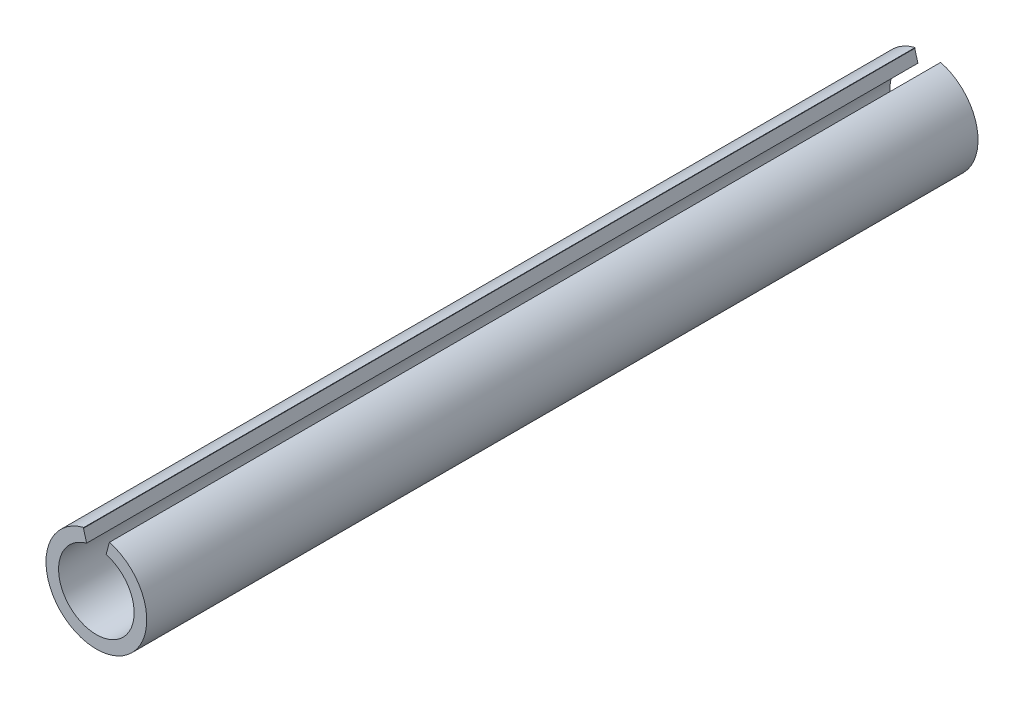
ISO-10303-21;
HEADER;
FILE_DESCRIPTION(('STEP AP214'),'2;1');
FILE_NAME('part.step','',(''),(''),'','','');
FILE_SCHEMA(('AUTOMOTIVE_DESIGN { 1 0 10303 214 1 1 1 1 }'));
ENDSEC;
DATA;
#1=APPLICATION_CONTEXT('core data for automotive mechanical design processes');
#2=APPLICATION_PROTOCOL_DEFINITION('international standard','automotive_design',2000,#1);
#3=PRODUCT_CONTEXT('',#1,'mechanical');
#4=PRODUCT('Part','Part','',(#3));
#5=PRODUCT_RELATED_PRODUCT_CATEGORY('part','',(#4));
#6=PRODUCT_DEFINITION_FORMATION('','',#4);
#7=PRODUCT_DEFINITION_CONTEXT('part definition',#1,'design');
#8=PRODUCT_DEFINITION('design','',#6,#7);
#9=PRODUCT_DEFINITION_SHAPE('','',#8);
#10=(LENGTH_UNIT() NAMED_UNIT(*) SI_UNIT(.MILLI.,.METRE.));
#11=(NAMED_UNIT(*) PLANE_ANGLE_UNIT() SI_UNIT($,.RADIAN.));
#12=(NAMED_UNIT(*) SI_UNIT($,.STERADIAN.) SOLID_ANGLE_UNIT());
#13=UNCERTAINTY_MEASURE_WITH_UNIT(LENGTH_MEASURE(1.E-05),#10,'distance_accuracy_value','');
#14=(GEOMETRIC_REPRESENTATION_CONTEXT(3) GLOBAL_UNCERTAINTY_ASSIGNED_CONTEXT((#13)) GLOBAL_UNIT_ASSIGNED_CONTEXT((#10,
#11,#12)) REPRESENTATION_CONTEXT('',''));
#15=CARTESIAN_POINT('',(0.,0.,0.));
#16=DIRECTION('',(0.,0.,1.));
#17=DIRECTION('',(1.,0.,0.));
#18=AXIS2_PLACEMENT_3D('',#15,#16,#17);
#19=CARTESIAN_POINT('',(0.,0.,33.));
#20=DIRECTION('',(0.,0.,1.));
#21=DIRECTION('',(1.,0.,0.));
#22=AXIS2_PLACEMENT_3D('',#19,#20,#21);
#23=PLANE('',#22);
#24=DIRECTION('',(0.258819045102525,0.965925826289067,0.));
#25=VECTOR('',#24,1.);
#26=CARTESIAN_POINT('',(0.,0.,33.));
#27=LINE('',#26,#25);
#28=CARTESIAN_POINT('',(0.388228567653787,1.4488887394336,33.));
#29=VERTEX_POINT('',#28);
#30=CARTESIAN_POINT('',(0.51763809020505,1.93185165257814,33.));
#31=VERTEX_POINT('',#30);
#32=EDGE_CURVE('E98',#29,#31,#27,.T.);
#33=ORIENTED_EDGE('',*,*,#32,.F.);
#34=CARTESIAN_POINT('',(0.,0.,33.));
#35=DIRECTION('',(0.,0.,1.));
#36=DIRECTION('',(1.,0.,0.));
#37=AXIS2_PLACEMENT_3D('',#34,#35,#36);
#38=CIRCLE('',#37,1.5);
#39=CARTESIAN_POINT('',(-0.388228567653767,1.44888873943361,33.));
#40=VERTEX_POINT('',#39);
#41=EDGE_CURVE('E108',#40,#29,#38,.T.);
#42=ORIENTED_EDGE('',*,*,#41,.F.);
#43=DIRECTION('',(0.258819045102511,-0.965925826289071,0.));
#44=VECTOR('',#43,1.);
#45=CARTESIAN_POINT('',(-0.509835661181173,1.90273259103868,33.));
#46=LINE('',#45,#44);
#47=CARTESIAN_POINT('',(-0.509835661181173,1.90273259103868,33.));
#48=VERTEX_POINT('',#47);
#49=EDGE_CURVE('E54',#48,#40,#46,.T.);
#50=ORIENTED_EDGE('',*,*,#49,.F.);
#51=DIRECTION('',(-0.385756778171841,-0.922600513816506,0.));
#52=VECTOR('',#51,1.);
#53=CARTESIAN_POINT('',(-0.0963855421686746,2.89156626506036,33.));
#54=LINE('',#53,#52);
#55=CARTESIAN_POINT('',(-0.495205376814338,1.93772331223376,33.));
#56=VERTEX_POINT('',#55);
#57=EDGE_CURVE('E83',#56,#48,#54,.T.);
#58=ORIENTED_EDGE('',*,*,#57,.F.);
#59=CARTESIAN_POINT('',(0.,0.,33.));
#60=DIRECTION('',(0.,0.,1.));
#61=DIRECTION('',(1.,0.,0.));
#62=AXIS2_PLACEMENT_3D('',#59,#60,#61);
#63=CIRCLE('',#62,2.);
#64=EDGE_CURVE('E112',#56,#31,#63,.T.);
#65=ORIENTED_EDGE('',*,*,#64,.T.);
#66=EDGE_LOOP('',(#33,#42,#50,#58,#65));
#67=FACE_BOUND('',#66,.T.);
#68=ADVANCED_FACE('F31',(#67),#23,.T.);
#69=CARTESIAN_POINT('',(0.,0.,0.));
#70=DIRECTION('',(0.,0.,1.));
#71=DIRECTION('',(1.,0.,0.));
#72=AXIS2_PLACEMENT_3D('',#69,#70,#71);
#73=PLANE('',#72);
#74=CARTESIAN_POINT('',(0.,0.,0.));
#75=DIRECTION('',(0.,0.,1.));
#76=DIRECTION('',(1.,0.,0.));
#77=AXIS2_PLACEMENT_3D('',#74,#75,#76);
#78=CIRCLE('',#77,1.5);
#79=CARTESIAN_POINT('',(-0.388228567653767,1.44888873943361,0.));
#80=VERTEX_POINT('',#79);
#81=CARTESIAN_POINT('',(0.388228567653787,1.4488887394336,0.));
#82=VERTEX_POINT('',#81);
#83=EDGE_CURVE('E106',#80,#82,#78,.T.);
#84=ORIENTED_EDGE('',*,*,#83,.T.);
#85=DIRECTION('',(0.258819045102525,0.965925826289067,0.));
#86=VECTOR('',#85,1.);
#87=CARTESIAN_POINT('',(0.,0.,0.));
#88=LINE('',#87,#86);
#89=CARTESIAN_POINT('',(0.51763809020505,1.93185165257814,0.));
#90=VERTEX_POINT('',#89);
#91=EDGE_CURVE('E46',#82,#90,#88,.T.);
#92=ORIENTED_EDGE('',*,*,#91,.T.);
#93=CARTESIAN_POINT('',(0.,0.,0.));
#94=DIRECTION('',(0.,0.,1.));
#95=DIRECTION('',(1.,0.,0.));
#96=AXIS2_PLACEMENT_3D('',#93,#94,#95);
#97=CIRCLE('',#96,2.);
#98=CARTESIAN_POINT('',(-0.495205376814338,1.93772331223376,0.));
#99=VERTEX_POINT('',#98);
#100=EDGE_CURVE('E97',#99,#90,#97,.T.);
#101=ORIENTED_EDGE('',*,*,#100,.F.);
#102=DIRECTION('',(-0.385756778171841,-0.922600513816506,0.));
#103=VECTOR('',#102,1.);
#104=CARTESIAN_POINT('',(-0.0963855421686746,2.89156626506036,0.));
#105=LINE('',#104,#103);
#106=CARTESIAN_POINT('',(-0.509835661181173,1.90273259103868,0.));
#107=VERTEX_POINT('',#106);
#108=EDGE_CURVE('E81',#99,#107,#105,.T.);
#109=ORIENTED_EDGE('',*,*,#108,.T.);
#110=DIRECTION('',(0.258819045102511,-0.965925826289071,0.));
#111=VECTOR('',#110,1.);
#112=CARTESIAN_POINT('',(-0.509835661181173,1.90273259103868,0.));
#113=LINE('',#112,#111);
#114=EDGE_CURVE('E87',#107,#80,#113,.T.);
#115=ORIENTED_EDGE('',*,*,#114,.T.);
#116=EDGE_LOOP('',(#84,#92,#101,#109,#115));
#117=FACE_BOUND('',#116,.T.);
#118=ADVANCED_FACE('F95',(#117),#73,.F.);
#119=CARTESIAN_POINT('',(0.,0.,33.));
#120=DIRECTION('',(0.,0.,-1.));
#121=DIRECTION('',(-1.,0.,0.));
#122=AXIS2_PLACEMENT_3D('',#119,#120,#121);
#123=CYLINDRICAL_SURFACE('',#122,2.);
#124=ORIENTED_EDGE('',*,*,#64,.F.);
#125=DIRECTION('',(0.,0.,-1.));
#126=VECTOR('',#125,1.);
#127=CARTESIAN_POINT('',(-0.495205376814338,1.93772331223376,33.));
#128=LINE('',#127,#126);
#129=EDGE_CURVE('E11',#56,#99,#128,.T.);
#130=ORIENTED_EDGE('',*,*,#129,.T.);
#131=ORIENTED_EDGE('',*,*,#100,.T.);
#132=DIRECTION('',(0.,0.,1.));
#133=VECTOR('',#132,1.);
#134=CARTESIAN_POINT('',(0.51763809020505,1.93185165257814,0.));
#135=LINE('',#134,#133);
#136=EDGE_CURVE('E84',#90,#31,#135,.T.);
#137=ORIENTED_EDGE('',*,*,#136,.T.);
#138=EDGE_LOOP('',(#124,#130,#131,#137));
#139=FACE_BOUND('',#138,.T.);
#140=ADVANCED_FACE('F33',(#139),#123,.T.);
#141=CARTESIAN_POINT('',(0.,0.,33.));
#142=DIRECTION('',(0.,0.,-1.));
#143=DIRECTION('',(-1.,0.,0.));
#144=AXIS2_PLACEMENT_3D('',#141,#142,#143);
#145=CYLINDRICAL_SURFACE('',#144,1.5);
#146=DIRECTION('',(0.,0.,-1.));
#147=VECTOR('',#146,1.);
#148=CARTESIAN_POINT('',(0.388228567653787,1.4488887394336,33.));
#149=LINE('',#148,#147);
#150=EDGE_CURVE('E39',#82,#29,#149,.F.);
#151=ORIENTED_EDGE('',*,*,#150,.F.);
#152=ORIENTED_EDGE('',*,*,#83,.F.);
#153=DIRECTION('',(0.,0.,-1.));
#154=VECTOR('',#153,1.);
#155=CARTESIAN_POINT('',(-0.388228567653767,1.44888873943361,33.));
#156=LINE('',#155,#154);
#157=EDGE_CURVE('E89',#40,#80,#156,.T.);
#158=ORIENTED_EDGE('',*,*,#157,.F.);
#159=ORIENTED_EDGE('',*,*,#41,.T.);
#160=EDGE_LOOP('',(#151,#152,#158,#159));
#161=FACE_BOUND('',#160,.T.);
#162=ADVANCED_FACE('F122',(#161),#145,.F.);
#163=CARTESIAN_POINT('',(-0.509835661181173,1.90273259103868,0.));
#164=DIRECTION('',(-0.965925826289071,-0.258819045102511,0.));
#165=DIRECTION('',(0.258819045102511,-0.965925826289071,0.));
#166=AXIS2_PLACEMENT_3D('',#163,#164,#165);
#167=PLANE('',#166);
#168=ORIENTED_EDGE('',*,*,#157,.T.);
#169=ORIENTED_EDGE('',*,*,#114,.F.);
#170=DIRECTION('',(0.,0.,1.));
#171=VECTOR('',#170,1.);
#172=CARTESIAN_POINT('',(-0.509835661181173,1.90273259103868,0.));
#173=LINE('',#172,#171);
#174=EDGE_CURVE('E77',#107,#48,#173,.T.);
#175=ORIENTED_EDGE('',*,*,#174,.T.);
#176=ORIENTED_EDGE('',*,*,#49,.T.);
#177=EDGE_LOOP('',(#168,#169,#175,#176));
#178=FACE_BOUND('',#177,.T.);
#179=ADVANCED_FACE('F88',(#178),#167,.F.);
#180=CARTESIAN_POINT('',(-0.0963855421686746,2.89156626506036,0.));
#181=DIRECTION('',(-0.922600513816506,0.385756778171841,0.));
#182=DIRECTION('',(-0.385756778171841,-0.922600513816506,0.));
#183=AXIS2_PLACEMENT_3D('',#180,#181,#182);
#184=PLANE('',#183);
#185=ORIENTED_EDGE('',*,*,#57,.T.);
#186=ORIENTED_EDGE('',*,*,#174,.F.);
#187=ORIENTED_EDGE('',*,*,#108,.F.);
#188=ORIENTED_EDGE('',*,*,#129,.F.);
#189=EDGE_LOOP('',(#185,#186,#187,#188));
#190=FACE_BOUND('',#189,.T.);
#191=ADVANCED_FACE('F79',(#190),#184,.F.);
#192=CARTESIAN_POINT('',(0.,0.,0.));
#193=DIRECTION('',(0.965925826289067,-0.258819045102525,0.));
#194=DIRECTION('',(0.258819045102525,0.965925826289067,0.));
#195=AXIS2_PLACEMENT_3D('',#192,#193,#194);
#196=PLANE('',#195);
#197=ORIENTED_EDGE('',*,*,#150,.T.);
#198=ORIENTED_EDGE('',*,*,#32,.T.);
#199=ORIENTED_EDGE('',*,*,#136,.F.);
#200=ORIENTED_EDGE('',*,*,#91,.F.);
#201=EDGE_LOOP('',(#197,#198,#199,#200));
#202=FACE_BOUND('',#201,.T.);
#203=ADVANCED_FACE('F117',(#202),#196,.F.);
#204=CLOSED_SHELL('',(#68,#118,#140,#162,#179,#191,#203));
#205=MANIFOLD_SOLID_BREP('B2',#204);
#206=ADVANCED_BREP_SHAPE_REPRESENTATION('',(#18,#205),#14);
#207=SHAPE_DEFINITION_REPRESENTATION(#9,#206);
ENDSEC;
END-ISO-10303-21;
